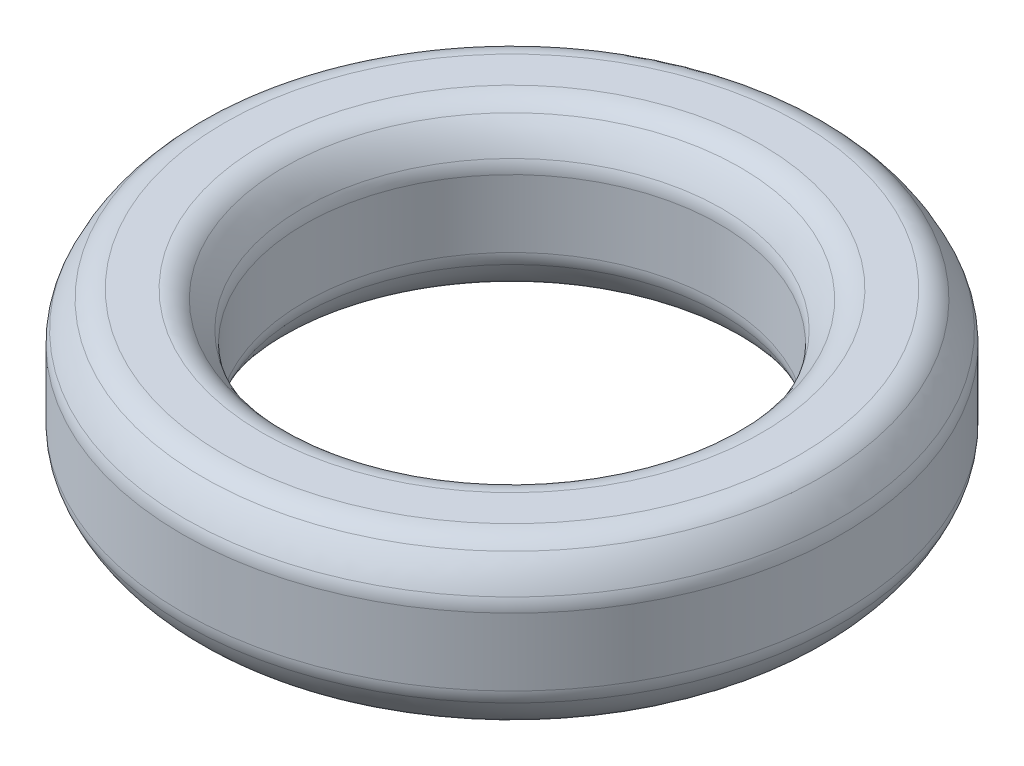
ISO-10303-21;
HEADER;
FILE_DESCRIPTION(('STEP AP214'),'2;1');
FILE_NAME('part.step','',(''),(''),'','','');
FILE_SCHEMA(('AUTOMOTIVE_DESIGN { 1 0 10303 214 1 1 1 1 }'));
ENDSEC;
DATA;
#1=APPLICATION_CONTEXT('core data for automotive mechanical design processes');
#2=APPLICATION_PROTOCOL_DEFINITION('international standard','automotive_design',2000,#1);
#3=PRODUCT_CONTEXT('',#1,'mechanical');
#4=PRODUCT('Part','Part','',(#3));
#5=PRODUCT_RELATED_PRODUCT_CATEGORY('part','',(#4));
#6=PRODUCT_DEFINITION_FORMATION('','',#4);
#7=PRODUCT_DEFINITION_CONTEXT('part definition',#1,'design');
#8=PRODUCT_DEFINITION('design','',#6,#7);
#9=PRODUCT_DEFINITION_SHAPE('','',#8);
#10=(LENGTH_UNIT() NAMED_UNIT(*) SI_UNIT(.MILLI.,.METRE.));
#11=(NAMED_UNIT(*) PLANE_ANGLE_UNIT() SI_UNIT($,.RADIAN.));
#12=(NAMED_UNIT(*) SI_UNIT($,.STERADIAN.) SOLID_ANGLE_UNIT());
#13=UNCERTAINTY_MEASURE_WITH_UNIT(LENGTH_MEASURE(1.E-05),#10,'distance_accuracy_value','');
#14=(GEOMETRIC_REPRESENTATION_CONTEXT(3) GLOBAL_UNCERTAINTY_ASSIGNED_CONTEXT((#13)) GLOBAL_UNIT_ASSIGNED_CONTEXT((#10,
#11,#12)) REPRESENTATION_CONTEXT('',''));
#15=CARTESIAN_POINT('',(0.,0.,0.));
#16=DIRECTION('',(0.,0.,1.));
#17=DIRECTION('',(1.,0.,0.));
#18=AXIS2_PLACEMENT_3D('',#15,#16,#17);
#19=CARTESIAN_POINT('',(4.075,1.2375,0.));
#20=DIRECTION('',(0.,0.,1.));
#21=DIRECTION('',(0.,1.,0.));
#22=AXIS2_PLACEMENT_3D('',#19,#20,#21);
#23=ELLIPSE('',#22,1.375,1.02777777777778);
#24=CARTESIAN_POINT('',(0.,0.,0.));
#25=DIRECTION('',(0.,-1.,0.));
#26=AXIS1_PLACEMENT('',#24,#25);
#27=SURFACE_OF_REVOLUTION('',#23,#26);
#28=CARTESIAN_POINT('',(0.,2.34127716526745,0.));
#29=DIRECTION('',(0.,-1.,0.));
#30=DIRECTION('',(0.,0.,-1.));
#31=AXIS2_PLACEMENT_3D('',#28,#29,#30);
#32=CIRCLE('',#31,4.68788415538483);
#33=CARTESIAN_POINT('',(0.,2.34127716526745,-4.68788415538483));
#34=VERTEX_POINT('',#33);
#35=EDGE_CURVE('E64',#34,#34,#32,.T.);
#36=ORIENTED_EDGE('',*,*,#35,.T.);
#37=EDGE_LOOP('',(#36));
#38=FACE_BOUND('',#37,.T.);
#39=CARTESIAN_POINT('',(0.,1.9339508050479,0.));
#40=DIRECTION('',(0.,-1.,0.));
#41=DIRECTION('',(0.,0.,-1.));
#42=AXIS2_PLACEMENT_3D('',#39,#40,#41);
#43=CIRCLE('',#42,4.96118522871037);
#44=CARTESIAN_POINT('',(0.,1.9339508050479,-4.96118522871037));
#45=VERTEX_POINT('',#44);
#46=EDGE_CURVE('E67',#45,#45,#43,.F.);
#47=ORIENTED_EDGE('',*,*,#46,.T.);
#48=EDGE_LOOP('',(#47));
#49=FACE_BOUND('',#48,.T.);
#50=ADVANCED_FACE('F14',(#38,#49),#27,.F.);
#51=CARTESIAN_POINT('',(3.62700205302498,2.475,0.));
#52=DIRECTION('',(0.,1.,0.));
#53=DIRECTION('',(0.,0.,1.));
#54=AXIS2_PLACEMENT_3D('',#51,#52,#53);
#55=PLANE('',#54);
#56=CARTESIAN_POINT('',(0.,2.475,0.));
#57=DIRECTION('',(0.,1.,0.));
#58=DIRECTION('',(0.,0.,1.));
#59=AXIS2_PLACEMENT_3D('',#56,#57,#58);
#60=CIRCLE('',#59,4.36362621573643);
#61=CARTESIAN_POINT('',(0.,2.475,4.36362621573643));
#62=VERTEX_POINT('',#61);
#63=EDGE_CURVE('E58',#62,#62,#60,.T.);
#64=ORIENTED_EDGE('',*,*,#63,.T.);
#65=EDGE_LOOP('',(#64));
#66=FACE_BOUND('',#65,.T.);
#67=CARTESIAN_POINT('',(0.,2.475,0.));
#68=DIRECTION('',(0.,1.,0.));
#69=DIRECTION('',(0.,0.,1.));
#70=AXIS2_PLACEMENT_3D('',#67,#68,#69);
#71=CIRCLE('',#70,3.78637378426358);
#72=CARTESIAN_POINT('',(0.,2.475,3.78637378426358));
#73=VERTEX_POINT('',#72);
#74=EDGE_CURVE('E61',#73,#73,#71,.F.);
#75=ORIENTED_EDGE('',*,*,#74,.T.);
#76=EDGE_LOOP('',(#75));
#77=FACE_BOUND('',#76,.T.);
#78=ADVANCED_FACE('F96',(#66,#77),#55,.T.);
#79=CARTESIAN_POINT('',(4.075,1.2375,0.));
#80=DIRECTION('',(0.,0.,1.));
#81=DIRECTION('',(0.,1.,0.));
#82=AXIS2_PLACEMENT_3D('',#79,#80,#81);
#83=ELLIPSE('',#82,1.375,1.02777777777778);
#84=CARTESIAN_POINT('',(0.,0.,0.));
#85=DIRECTION('',(0.,-1.,0.));
#86=AXIS1_PLACEMENT('',#84,#85);
#87=SURFACE_OF_REVOLUTION('',#83,#86);
#88=CARTESIAN_POINT('',(0.,2.34127716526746,0.));
#89=DIRECTION('',(0.,-1.,0.));
#90=DIRECTION('',(0.,0.,-1.));
#91=AXIS2_PLACEMENT_3D('',#88,#89,#90);
#92=CIRCLE('',#91,3.46211584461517);
#93=CARTESIAN_POINT('',(0.,2.34127716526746,-3.46211584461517));
#94=VERTEX_POINT('',#93);
#95=EDGE_CURVE('E52',#94,#94,#92,.F.);
#96=ORIENTED_EDGE('',*,*,#95,.T.);
#97=EDGE_LOOP('',(#96));
#98=FACE_BOUND('',#97,.T.);
#99=CARTESIAN_POINT('',(0.,1.93395080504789,0.));
#100=DIRECTION('',(0.,-1.,0.));
#101=DIRECTION('',(0.,0.,-1.));
#102=AXIS2_PLACEMENT_3D('',#99,#100,#101);
#103=CIRCLE('',#102,3.18881477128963);
#104=CARTESIAN_POINT('',(0.,1.93395080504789,-3.18881477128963));
#105=VERTEX_POINT('',#104);
#106=EDGE_CURVE('E55',#105,#105,#103,.T.);
#107=ORIENTED_EDGE('',*,*,#106,.T.);
#108=EDGE_LOOP('',(#107));
#109=FACE_BOUND('',#108,.T.);
#110=ADVANCED_FACE('F92',(#98,#109),#87,.F.);
#111=CARTESIAN_POINT('',(0.,0.,0.));
#112=DIRECTION('',(0.,-1.,0.));
#113=DIRECTION('',(0.,0.,-1.));
#114=AXIS2_PLACEMENT_3D('',#111,#112,#113);
#115=CYLINDRICAL_SURFACE('',#114,3.15);
#116=CARTESIAN_POINT('',(0.,1.74901026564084,0.));
#117=DIRECTION('',(0.,1.,0.));
#118=DIRECTION('',(0.,0.,1.));
#119=AXIS2_PLACEMENT_3D('',#116,#117,#118);
#120=CIRCLE('',#119,3.15);
#121=CARTESIAN_POINT('',(0.,1.74901026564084,3.15));
#122=VERTEX_POINT('',#121);
#123=EDGE_CURVE('E46',#122,#122,#120,.T.);
#124=ORIENTED_EDGE('',*,*,#123,.T.);
#125=EDGE_LOOP('',(#124));
#126=FACE_BOUND('',#125,.T.);
#127=CARTESIAN_POINT('',(0.,0.725989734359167,0.));
#128=DIRECTION('',(0.,1.,0.));
#129=DIRECTION('',(0.,0.,1.));
#130=AXIS2_PLACEMENT_3D('',#127,#128,#129);
#131=CIRCLE('',#130,3.15);
#132=CARTESIAN_POINT('',(0.,0.725989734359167,3.15));
#133=VERTEX_POINT('',#132);
#134=EDGE_CURVE('E49',#133,#133,#131,.F.);
#135=ORIENTED_EDGE('',*,*,#134,.T.);
#136=EDGE_LOOP('',(#135));
#137=FACE_BOUND('',#136,.T.);
#138=ADVANCED_FACE('F88',(#126,#137),#115,.F.);
#139=CARTESIAN_POINT('',(4.075,1.2375,0.));
#140=DIRECTION('',(0.,0.,1.));
#141=DIRECTION('',(0.,1.,0.));
#142=AXIS2_PLACEMENT_3D('',#139,#140,#141);
#143=ELLIPSE('',#142,1.375,1.02777777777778);
#144=CARTESIAN_POINT('',(0.,0.,0.));
#145=DIRECTION('',(0.,-1.,0.));
#146=AXIS1_PLACEMENT('',#144,#145);
#147=SURFACE_OF_REVOLUTION('',#143,#146);
#148=CARTESIAN_POINT('',(0.,0.541049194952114,0.));
#149=DIRECTION('',(0.,-1.,0.));
#150=DIRECTION('',(0.,0.,-1.));
#151=AXIS2_PLACEMENT_3D('',#148,#149,#150);
#152=CIRCLE('',#151,3.18881477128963);
#153=CARTESIAN_POINT('',(0.,0.541049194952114,-3.18881477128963));
#154=VERTEX_POINT('',#153);
#155=EDGE_CURVE('E40',#154,#154,#152,.F.);
#156=ORIENTED_EDGE('',*,*,#155,.T.);
#157=EDGE_LOOP('',(#156));
#158=FACE_BOUND('',#157,.T.);
#159=CARTESIAN_POINT('',(0.,0.133722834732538,0.));
#160=DIRECTION('',(0.,-1.,0.));
#161=DIRECTION('',(0.,0.,-1.));
#162=AXIS2_PLACEMENT_3D('',#159,#160,#161);
#163=CIRCLE('',#162,3.46211584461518);
#164=CARTESIAN_POINT('',(0.,0.133722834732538,-3.46211584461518));
#165=VERTEX_POINT('',#164);
#166=EDGE_CURVE('E43',#165,#165,#163,.T.);
#167=ORIENTED_EDGE('',*,*,#166,.T.);
#168=EDGE_LOOP('',(#167));
#169=FACE_BOUND('',#168,.T.);
#170=ADVANCED_FACE('F84',(#158,#169),#147,.F.);
#171=CARTESIAN_POINT('',(3.62700205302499,0.,0.));
#172=DIRECTION('',(0.,-1.,0.));
#173=DIRECTION('',(0.,0.,-1.));
#174=AXIS2_PLACEMENT_3D('',#171,#172,#173);
#175=PLANE('',#174);
#176=CARTESIAN_POINT('',(0.,0.,0.));
#177=DIRECTION('',(0.,-1.,0.));
#178=DIRECTION('',(0.,0.,-1.));
#179=AXIS2_PLACEMENT_3D('',#176,#177,#178);
#180=CIRCLE('',#179,3.78637378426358);
#181=CARTESIAN_POINT('',(0.,0.,-3.78637378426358));
#182=VERTEX_POINT('',#181);
#183=EDGE_CURVE('E34',#182,#182,#180,.F.);
#184=ORIENTED_EDGE('',*,*,#183,.T.);
#185=EDGE_LOOP('',(#184));
#186=FACE_BOUND('',#185,.T.);
#187=CARTESIAN_POINT('',(0.,0.,0.));
#188=DIRECTION('',(0.,-1.,0.));
#189=DIRECTION('',(0.,0.,-1.));
#190=AXIS2_PLACEMENT_3D('',#187,#188,#189);
#191=CIRCLE('',#190,4.36362621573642);
#192=CARTESIAN_POINT('',(0.,0.,-4.36362621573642));
#193=VERTEX_POINT('',#192);
#194=EDGE_CURVE('E37',#193,#193,#191,.T.);
#195=ORIENTED_EDGE('',*,*,#194,.T.);
#196=EDGE_LOOP('',(#195));
#197=FACE_BOUND('',#196,.T.);
#198=ADVANCED_FACE('F80',(#186,#197),#175,.T.);
#199=CARTESIAN_POINT('',(4.075,1.2375,0.));
#200=DIRECTION('',(0.,0.,1.));
#201=DIRECTION('',(0.,1.,0.));
#202=AXIS2_PLACEMENT_3D('',#199,#200,#201);
#203=ELLIPSE('',#202,1.375,1.02777777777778);
#204=CARTESIAN_POINT('',(0.,0.,0.));
#205=DIRECTION('',(0.,-1.,0.));
#206=AXIS1_PLACEMENT('',#204,#205);
#207=SURFACE_OF_REVOLUTION('',#203,#206);
#208=CARTESIAN_POINT('',(0.,0.133722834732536,0.));
#209=DIRECTION('',(0.,-1.,0.));
#210=DIRECTION('',(0.,0.,-1.));
#211=AXIS2_PLACEMENT_3D('',#208,#209,#210);
#212=CIRCLE('',#211,4.68788415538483);
#213=CARTESIAN_POINT('',(0.,0.133722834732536,-4.68788415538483));
#214=VERTEX_POINT('',#213);
#215=EDGE_CURVE('E25',#214,#214,#212,.F.);
#216=ORIENTED_EDGE('',*,*,#215,.T.);
#217=EDGE_LOOP('',(#216));
#218=FACE_BOUND('',#217,.T.);
#219=CARTESIAN_POINT('',(0.,0.5410491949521,0.));
#220=DIRECTION('',(0.,-1.,0.));
#221=DIRECTION('',(0.,0.,-1.));
#222=AXIS2_PLACEMENT_3D('',#219,#220,#221);
#223=CIRCLE('',#222,4.96118522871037);
#224=CARTESIAN_POINT('',(0.,0.5410491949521,-4.96118522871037));
#225=VERTEX_POINT('',#224);
#226=EDGE_CURVE('E29',#225,#225,#223,.T.);
#227=ORIENTED_EDGE('',*,*,#226,.T.);
#228=EDGE_LOOP('',(#227));
#229=FACE_BOUND('',#228,.T.);
#230=ADVANCED_FACE('F75',(#218,#229),#207,.F.);
#231=CARTESIAN_POINT('',(0.,0.,0.));
#232=DIRECTION('',(0.,-1.,0.));
#233=DIRECTION('',(0.,0.,-1.));
#234=AXIS2_PLACEMENT_3D('',#231,#232,#233);
#235=CYLINDRICAL_SURFACE('',#234,5.);
#236=CARTESIAN_POINT('',(0.,0.725989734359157,0.));
#237=DIRECTION('',(0.,1.,0.));
#238=DIRECTION('',(0.,0.,1.));
#239=AXIS2_PLACEMENT_3D('',#236,#237,#238);
#240=CIRCLE('',#239,5.);
#241=CARTESIAN_POINT('',(0.,0.725989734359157,5.));
#242=VERTEX_POINT('',#241);
#243=EDGE_CURVE('E10',#242,#242,#240,.T.);
#244=ORIENTED_EDGE('',*,*,#243,.T.);
#245=EDGE_LOOP('',(#244));
#246=FACE_BOUND('',#245,.T.);
#247=CARTESIAN_POINT('',(0.,1.74901026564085,0.));
#248=DIRECTION('',(0.,1.,0.));
#249=DIRECTION('',(0.,0.,1.));
#250=AXIS2_PLACEMENT_3D('',#247,#248,#249);
#251=CIRCLE('',#250,5.);
#252=CARTESIAN_POINT('',(0.,1.74901026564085,5.));
#253=VERTEX_POINT('',#252);
#254=EDGE_CURVE('E21',#253,#253,#251,.F.);
#255=ORIENTED_EDGE('',*,*,#254,.T.);
#256=EDGE_LOOP('',(#255));
#257=FACE_BOUND('',#256,.T.);
#258=ADVANCED_FACE('F79',(#246,#257),#235,.T.);
#259=CARTESIAN_POINT('',(0.,2.015,0.));
#260=DIRECTION('',(0.,-1.,0.));
#261=DIRECTION('',(0.,0.,-1.));
#262=AXIS2_PLACEMENT_3D('',#259,#260,#261);
#263=TOROIDAL_SURFACE('',#262,4.36362621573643,0.46);
#264=ORIENTED_EDGE('',*,*,#63,.F.);
#265=EDGE_LOOP('',(#264));
#266=FACE_BOUND('',#265,.T.);
#267=ORIENTED_EDGE('',*,*,#35,.F.);
#268=EDGE_LOOP('',(#267));
#269=FACE_BOUND('',#268,.T.);
#270=ADVANCED_FACE('F105',(#266,#269),#263,.T.);
#271=CARTESIAN_POINT('',(0.,2.015,0.));
#272=DIRECTION('',(0.,-1.,0.));
#273=DIRECTION('',(0.,0.,-1.));
#274=AXIS2_PLACEMENT_3D('',#271,#272,#273);
#275=TOROIDAL_SURFACE('',#274,3.78637378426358,0.46);
#276=ORIENTED_EDGE('',*,*,#95,.F.);
#277=EDGE_LOOP('',(#276));
#278=FACE_BOUND('',#277,.T.);
#279=ORIENTED_EDGE('',*,*,#74,.F.);
#280=EDGE_LOOP('',(#279));
#281=FACE_BOUND('',#280,.T.);
#282=ADVANCED_FACE('F108',(#278,#281),#275,.T.);
#283=CARTESIAN_POINT('',(0.,1.74901026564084,0.));
#284=DIRECTION('',(0.,1.,0.));
#285=DIRECTION('',(0.,0.,1.));
#286=AXIS2_PLACEMENT_3D('',#283,#284,#285);
#287=TOROIDAL_SURFACE('',#286,3.61,0.46);
#288=ORIENTED_EDGE('',*,*,#123,.F.);
#289=EDGE_LOOP('',(#288));
#290=FACE_BOUND('',#289,.T.);
#291=ORIENTED_EDGE('',*,*,#106,.F.);
#292=EDGE_LOOP('',(#291));
#293=FACE_BOUND('',#292,.T.);
#294=ADVANCED_FACE('F112',(#290,#293),#287,.T.);
#295=CARTESIAN_POINT('',(0.,0.725989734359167,0.));
#296=DIRECTION('',(0.,1.,0.));
#297=DIRECTION('',(0.,0.,1.));
#298=AXIS2_PLACEMENT_3D('',#295,#296,#297);
#299=TOROIDAL_SURFACE('',#298,3.61,0.46);
#300=ORIENTED_EDGE('',*,*,#155,.F.);
#301=EDGE_LOOP('',(#300));
#302=FACE_BOUND('',#301,.T.);
#303=ORIENTED_EDGE('',*,*,#134,.F.);
#304=EDGE_LOOP('',(#303));
#305=FACE_BOUND('',#304,.T.);
#306=ADVANCED_FACE('F116',(#302,#305),#299,.T.);
#307=CARTESIAN_POINT('',(0.,0.46,0.));
#308=DIRECTION('',(0.,-1.,0.));
#309=DIRECTION('',(0.,0.,-1.));
#310=AXIS2_PLACEMENT_3D('',#307,#308,#309);
#311=TOROIDAL_SURFACE('',#310,3.78637378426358,0.46);
#312=ORIENTED_EDGE('',*,*,#183,.F.);
#313=EDGE_LOOP('',(#312));
#314=FACE_BOUND('',#313,.T.);
#315=ORIENTED_EDGE('',*,*,#166,.F.);
#316=EDGE_LOOP('',(#315));
#317=FACE_BOUND('',#316,.T.);
#318=ADVANCED_FACE('F120',(#314,#317),#311,.T.);
#319=CARTESIAN_POINT('',(0.,0.46,0.));
#320=DIRECTION('',(0.,-1.,0.));
#321=DIRECTION('',(0.,0.,-1.));
#322=AXIS2_PLACEMENT_3D('',#319,#320,#321);
#323=TOROIDAL_SURFACE('',#322,4.36362621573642,0.46);
#324=ORIENTED_EDGE('',*,*,#215,.F.);
#325=EDGE_LOOP('',(#324));
#326=FACE_BOUND('',#325,.T.);
#327=ORIENTED_EDGE('',*,*,#194,.F.);
#328=EDGE_LOOP('',(#327));
#329=FACE_BOUND('',#328,.T.);
#330=ADVANCED_FACE('F124',(#326,#329),#323,.T.);
#331=CARTESIAN_POINT('',(0.,0.725989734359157,0.));
#332=DIRECTION('',(0.,1.,0.));
#333=DIRECTION('',(0.,0.,1.));
#334=AXIS2_PLACEMENT_3D('',#331,#332,#333);
#335=TOROIDAL_SURFACE('',#334,4.54,0.46);
#336=ORIENTED_EDGE('',*,*,#243,.F.);
#337=EDGE_LOOP('',(#336));
#338=FACE_BOUND('',#337,.T.);
#339=ORIENTED_EDGE('',*,*,#226,.F.);
#340=EDGE_LOOP('',(#339));
#341=FACE_BOUND('',#340,.T.);
#342=ADVANCED_FACE('F127',(#338,#341),#335,.T.);
#343=CARTESIAN_POINT('',(0.,1.74901026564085,0.));
#344=DIRECTION('',(0.,1.,0.));
#345=DIRECTION('',(0.,0.,1.));
#346=AXIS2_PLACEMENT_3D('',#343,#344,#345);
#347=TOROIDAL_SURFACE('',#346,4.54,0.46);
#348=ORIENTED_EDGE('',*,*,#46,.F.);
#349=EDGE_LOOP('',(#348));
#350=FACE_BOUND('',#349,.T.);
#351=ORIENTED_EDGE('',*,*,#254,.F.);
#352=EDGE_LOOP('',(#351));
#353=FACE_BOUND('',#352,.T.);
#354=ADVANCED_FACE('F16',(#350,#353),#347,.T.);
#355=CLOSED_SHELL('',(#50,#78,#110,#138,#170,#198,#230,#258,#270,#282,#294,#306,#318,#330,#342,#354));
#356=MANIFOLD_SOLID_BREP('B1',#355);
#357=ADVANCED_BREP_SHAPE_REPRESENTATION('',(#18,#356),#14);
#358=SHAPE_DEFINITION_REPRESENTATION(#9,#357);
ENDSEC;
END-ISO-10303-21;
